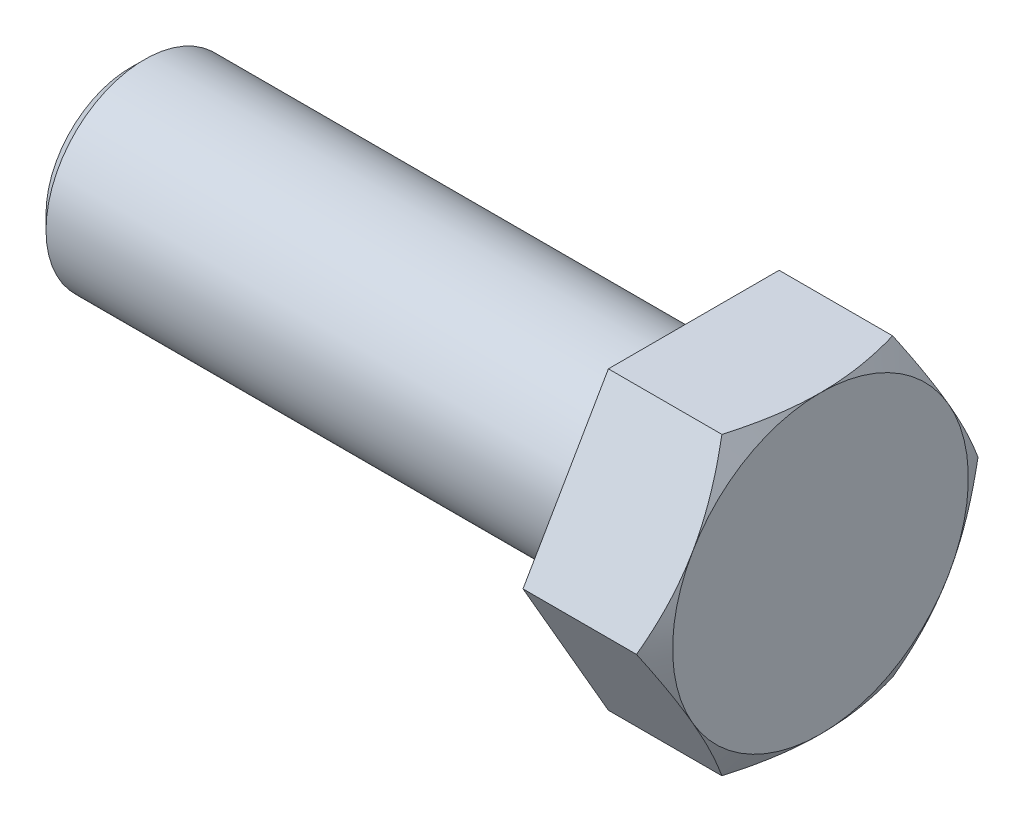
from build123d import *

# Parameters (mm, degrees)
BASE_EXTRUSION_DEPTH = 9
ESQUISSE2_R          = 7
BOSS_EXTRU_1_DEPTH   = 40
CHANFREIN1_SIZE      = 1


with BuildPart() as part:
    # Esquisse1 → Base-Extrusion (new body)
    with BuildSketch(Plane(origin=(0, 0, 0), x_dir=(0, 0, -1), z_dir=(1, 0, 0))):
        Polygon((12.124355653, 0), (6.062177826, 10.5), (-6.062177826, 10.5), (-12.124355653, 0), (-6.062177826, -10.5), (6.062177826, -10.5), align=None)
    extrude(amount=BASE_EXTRUSION_DEPTH)

    # Esquisse2 → Boss.-Extru.1 (add)
    with BuildSketch(Plane.ZY):
        Circle(ESQUISSE2_R)
    extrude(amount=BOSS_EXTRU_1_DEPTH)

    # Chanfrein1
    chanfrein1_edges = [part.edges().sort_by_distance(p)[0] for p in [
        (-40, 0, -7),
    ]]
    chamfer(chanfrein1_edges, length=CHANFREIN1_SIZE)

    # Esquisse3 → Enl_vement de mati_re-R_volution1 (revolve, cut)
    with BuildSketch(Plane.XY):
        Polygon((9, -10.5), (0, -26.088457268), (9, -26.088457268), align=None)
    revolve(axis=Axis((0, 0, 0), (1, 0, 0)), mode=Mode.SUBTRACT)


solid = part.part
